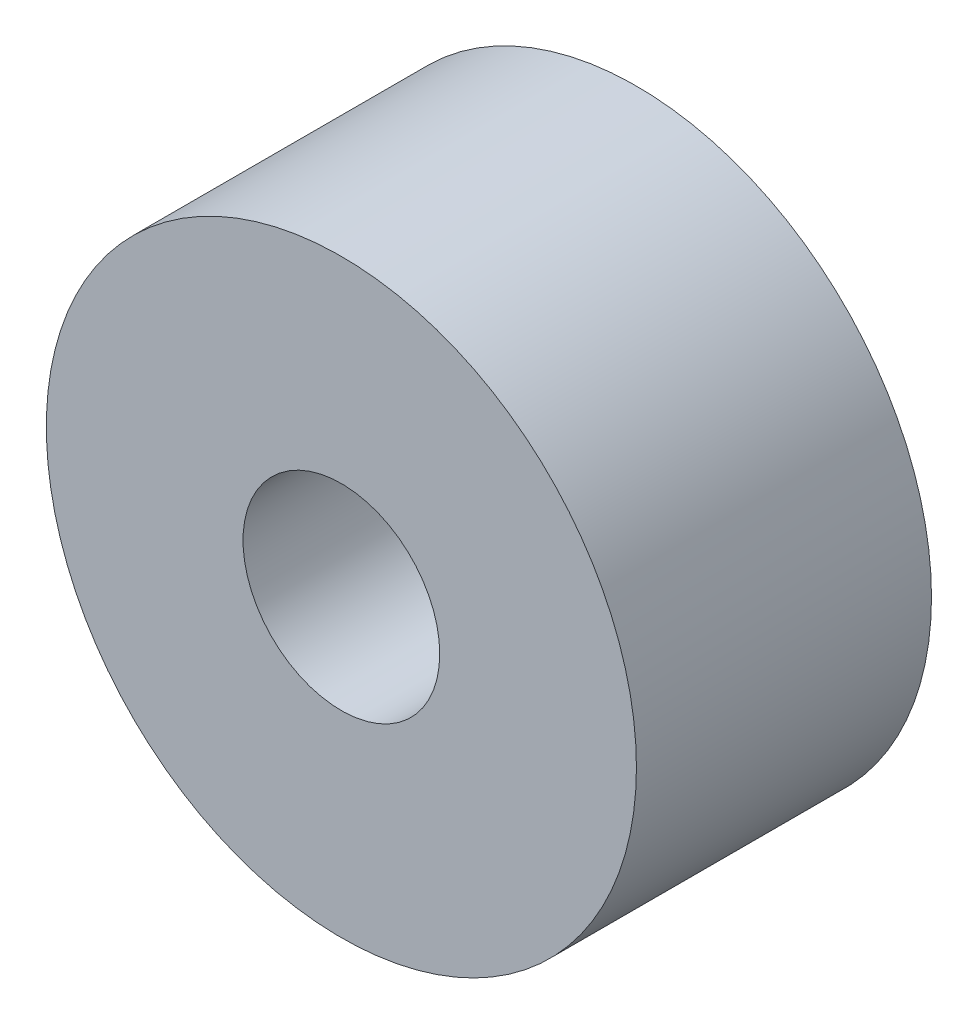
ISO-10303-21;
HEADER;
FILE_DESCRIPTION(('STEP AP214'),'2;1');
FILE_NAME('part.step','',(''),(''),'','','');
FILE_SCHEMA(('AUTOMOTIVE_DESIGN { 1 0 10303 214 1 1 1 1 }'));
ENDSEC;
DATA;
#1=APPLICATION_CONTEXT('core data for automotive mechanical design processes');
#2=APPLICATION_PROTOCOL_DEFINITION('international standard','automotive_design',2000,#1);
#3=PRODUCT_CONTEXT('',#1,'mechanical');
#4=PRODUCT('Part','Part','',(#3));
#5=PRODUCT_RELATED_PRODUCT_CATEGORY('part','',(#4));
#6=PRODUCT_DEFINITION_FORMATION('','',#4);
#7=PRODUCT_DEFINITION_CONTEXT('part definition',#1,'design');
#8=PRODUCT_DEFINITION('design','',#6,#7);
#9=PRODUCT_DEFINITION_SHAPE('','',#8);
#10=(LENGTH_UNIT() NAMED_UNIT(*) SI_UNIT(.MILLI.,.METRE.));
#11=(NAMED_UNIT(*) PLANE_ANGLE_UNIT() SI_UNIT($,.RADIAN.));
#12=(NAMED_UNIT(*) SI_UNIT($,.STERADIAN.) SOLID_ANGLE_UNIT());
#13=UNCERTAINTY_MEASURE_WITH_UNIT(LENGTH_MEASURE(1.E-05),#10,'distance_accuracy_value','');
#14=(GEOMETRIC_REPRESENTATION_CONTEXT(3) GLOBAL_UNCERTAINTY_ASSIGNED_CONTEXT((#13)) GLOBAL_UNIT_ASSIGNED_CONTEXT((#10,
#11,#12)) REPRESENTATION_CONTEXT('',''));
#15=CARTESIAN_POINT('',(0.,0.,0.));
#16=DIRECTION('',(0.,0.,1.));
#17=DIRECTION('',(1.,0.,0.));
#18=AXIS2_PLACEMENT_3D('',#15,#16,#17);
#19=CARTESIAN_POINT('',(0.,0.,15.));
#20=DIRECTION('',(0.,0.,-1.));
#21=DIRECTION('',(-1.,0.,0.));
#22=AXIS2_PLACEMENT_3D('',#19,#20,#21);
#23=CYLINDRICAL_SURFACE('',#22,5.);
#24=CARTESIAN_POINT('',(0.,0.,15.));
#25=DIRECTION('',(0.,0.,-1.));
#26=DIRECTION('',(1.,0.,0.));
#27=AXIS2_PLACEMENT_3D('',#24,#25,#26);
#28=CIRCLE('',#27,5.);
#29=CARTESIAN_POINT('',(5.,0.,15.));
#30=VERTEX_POINT('',#29);
#31=EDGE_CURVE('E10',#30,#30,#28,.T.);
#32=ORIENTED_EDGE('',*,*,#31,.F.);
#33=EDGE_LOOP('',(#32));
#34=FACE_BOUND('',#33,.T.);
#35=CARTESIAN_POINT('',(0.,0.,0.));
#36=DIRECTION('',(0.,0.,-1.));
#37=DIRECTION('',(1.,0.,0.));
#38=AXIS2_PLACEMENT_3D('',#35,#36,#37);
#39=CIRCLE('',#38,5.);
#40=CARTESIAN_POINT('',(5.,0.,0.));
#41=VERTEX_POINT('',#40);
#42=EDGE_CURVE('E26',#41,#41,#39,.T.);
#43=ORIENTED_EDGE('',*,*,#42,.T.);
#44=EDGE_LOOP('',(#43));
#45=FACE_BOUND('',#44,.T.);
#46=ADVANCED_FACE('F15',(#34,#45),#23,.F.);
#47=CARTESIAN_POINT('',(0.,0.,15.));
#48=DIRECTION('',(0.,0.,-1.));
#49=DIRECTION('',(-1.,0.,0.));
#50=AXIS2_PLACEMENT_3D('',#47,#48,#49);
#51=CYLINDRICAL_SURFACE('',#50,15.);
#52=CARTESIAN_POINT('',(0.,0.,15.));
#53=DIRECTION('',(0.,0.,-1.));
#54=DIRECTION('',(1.,0.,0.));
#55=AXIS2_PLACEMENT_3D('',#52,#53,#54);
#56=CIRCLE('',#55,15.);
#57=CARTESIAN_POINT('',(15.,0.,15.));
#58=VERTEX_POINT('',#57);
#59=EDGE_CURVE('E22',#58,#58,#56,.T.);
#60=ORIENTED_EDGE('',*,*,#59,.T.);
#61=EDGE_LOOP('',(#60));
#62=FACE_BOUND('',#61,.T.);
#63=CARTESIAN_POINT('',(0.,0.,0.));
#64=DIRECTION('',(0.,0.,-1.));
#65=DIRECTION('',(1.,0.,0.));
#66=AXIS2_PLACEMENT_3D('',#63,#64,#65);
#67=CIRCLE('',#66,15.);
#68=CARTESIAN_POINT('',(15.,0.,0.));
#69=VERTEX_POINT('',#68);
#70=EDGE_CURVE('E31',#69,#69,#67,.T.);
#71=ORIENTED_EDGE('',*,*,#70,.F.);
#72=EDGE_LOOP('',(#71));
#73=FACE_BOUND('',#72,.T.);
#74=ADVANCED_FACE('F17',(#62,#73),#51,.T.);
#75=CARTESIAN_POINT('',(0.,0.,15.));
#76=DIRECTION('',(0.,0.,-1.));
#77=DIRECTION('',(-1.,0.,0.));
#78=AXIS2_PLACEMENT_3D('',#75,#76,#77);
#79=PLANE('',#78);
#80=ORIENTED_EDGE('',*,*,#31,.T.);
#81=EDGE_LOOP('',(#80));
#82=FACE_BOUND('',#81,.T.);
#83=ORIENTED_EDGE('',*,*,#59,.F.);
#84=EDGE_LOOP('',(#83));
#85=FACE_BOUND('',#84,.T.);
#86=ADVANCED_FACE('F43',(#82,#85),#79,.F.);
#87=CARTESIAN_POINT('',(0.,0.,0.));
#88=DIRECTION('',(0.,0.,-1.));
#89=DIRECTION('',(-1.,0.,0.));
#90=AXIS2_PLACEMENT_3D('',#87,#88,#89);
#91=PLANE('',#90);
#92=ORIENTED_EDGE('',*,*,#42,.F.);
#93=EDGE_LOOP('',(#92));
#94=FACE_BOUND('',#93,.T.);
#95=ORIENTED_EDGE('',*,*,#70,.T.);
#96=EDGE_LOOP('',(#95));
#97=FACE_BOUND('',#96,.T.);
#98=ADVANCED_FACE('F40',(#94,#97),#91,.T.);
#99=CLOSED_SHELL('',(#46,#74,#86,#98));
#100=MANIFOLD_SOLID_BREP('B1',#99);
#101=ADVANCED_BREP_SHAPE_REPRESENTATION('',(#18,#100),#14);
#102=SHAPE_DEFINITION_REPRESENTATION(#9,#101);
ENDSEC;
END-ISO-10303-21;
